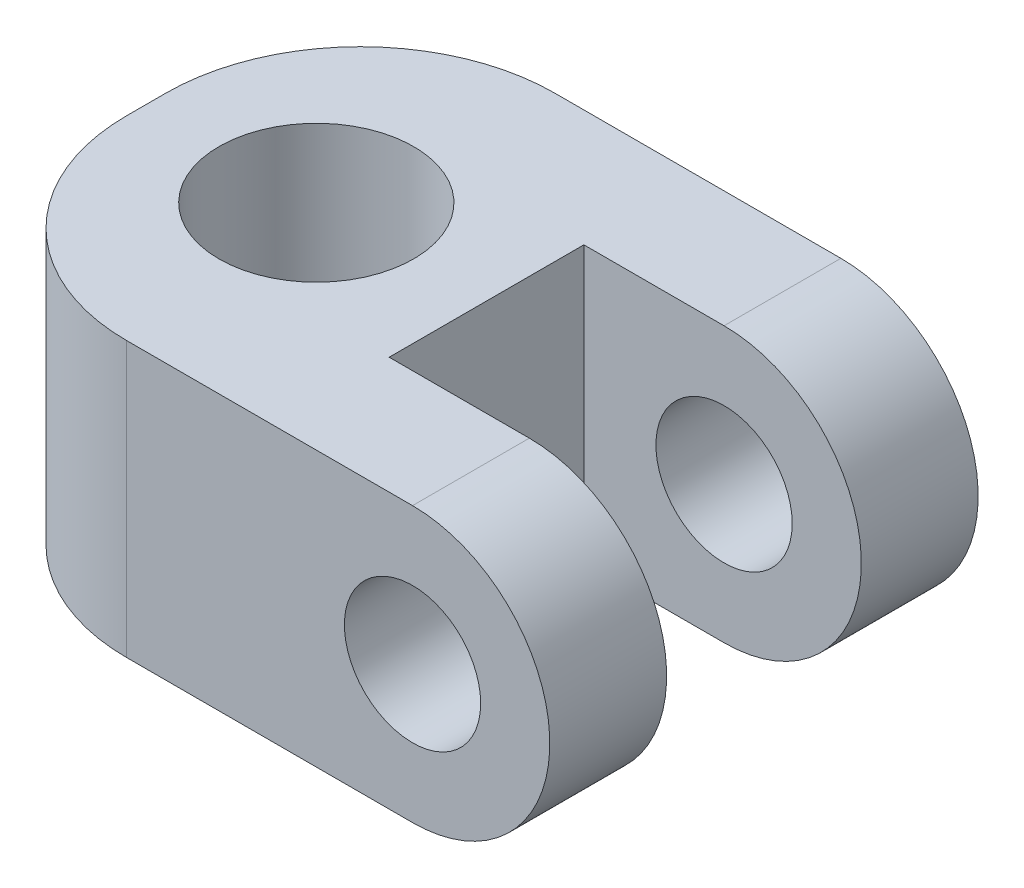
from build123d import *

# Parameters (mm, degrees)
SKETCH1_R           = 1.75
BOSS_EXTRUDE1_DEPTH = 3
SKETCH2_W           = 8.741203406
SKETCH2_H           = 7.05
BOSS_EXTRUDE2_DEPTH = 5
SKETCH3_R           = 1.75
BOSS_EXTRUDE3_DEPTH = 3
SKETCH4_R           = 2.5
CUT_EXTRUDE1_DEPTH  = 35.024701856
FILLET1_R           = 5


with BuildPart() as part:
    # Sketch1 → Boss-Extrude1 (new body)
    with BuildSketch(Plane.XY):
        with BuildLine():
            Line((-19.075, 25.775), (-31.416203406, 25.775))
            Line((-31.416203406, 25.775), (-31.416203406, 18.725))
            Line((-31.416203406, 18.725), (-19.075, 18.725))
            ThreePointArc((-19.075, 18.725), (-15.55, 22.25), (-19.075, 25.775))
        make_face()
        with Locations((-19.075, 22.25)):
            Circle(SKETCH1_R, mode=Mode.SUBTRACT)
    extrude(amount=BOSS_EXTRUDE1_DEPTH)

    # Sketch2 → Boss-Extrude2 (add)
    with BuildSketch(Plane.XY.offset(3)):
        with Locations((-27.045601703, 22.25)):
            Rectangle(SKETCH2_W, SKETCH2_H)
    extrude(amount=BOSS_EXTRUDE2_DEPTH)

    # Sketch3 → Boss-Extrude3 (add)
    with BuildSketch(Plane.XY.offset(8)):
        with BuildLine():
            Line((-19.075, 25.775), (-31.416203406, 25.775))
            Line((-31.416203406, 25.775), (-31.416203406, 18.725))
            Line((-31.416203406, 18.725), (-19.075, 18.725))
            ThreePointArc((-19.075, 18.725), (-15.55, 22.25), (-19.075, 25.775))
        make_face()
        with Locations((-19.075, 22.25)):
            Circle(SKETCH3_R, mode=Mode.SUBTRACT)
    extrude(amount=BOSS_EXTRUDE3_DEPTH)

    # Sketch4 → Cut-Extrude1 (cut, through all)
    with BuildSketch(Plane(origin=(0, 25.775, 0), x_dir=(1, 0, 0), z_dir=(0, 1, 0))):
        with Locations(Location((-27.045601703, -5.5, 0), (0, 0, 270))):
            Circle(SKETCH4_R)
    extrude(amount=-CUT_EXTRUDE1_DEPTH, mode=Mode.SUBTRACT)

    # Fillet1
    fillet1_edges = [part.edges().sort_by_distance(p)[0] for p in [
        (-31.416203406, 22.25, 11),
        (-31.416203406, 22.25, 0),
    ]]
    fillet(fillet1_edges, radius=FILLET1_R)


solid = part.part
